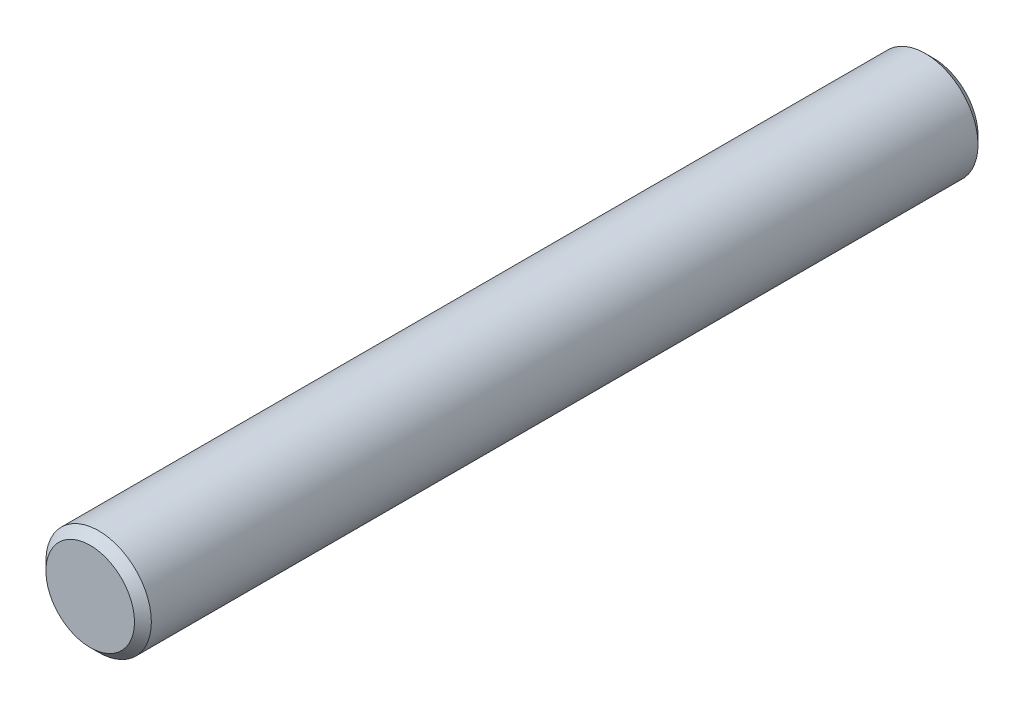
ISO-10303-21;
HEADER;
FILE_DESCRIPTION(('STEP AP214'),'2;1');
FILE_NAME('part.step','',(''),(''),'','','');
FILE_SCHEMA(('AUTOMOTIVE_DESIGN { 1 0 10303 214 1 1 1 1 }'));
ENDSEC;
DATA;
#1=APPLICATION_CONTEXT('core data for automotive mechanical design processes');
#2=APPLICATION_PROTOCOL_DEFINITION('international standard','automotive_design',2000,#1);
#3=PRODUCT_CONTEXT('',#1,'mechanical');
#4=PRODUCT('Part','Part','',(#3));
#5=PRODUCT_RELATED_PRODUCT_CATEGORY('part','',(#4));
#6=PRODUCT_DEFINITION_FORMATION('','',#4);
#7=PRODUCT_DEFINITION_CONTEXT('part definition',#1,'design');
#8=PRODUCT_DEFINITION('design','',#6,#7);
#9=PRODUCT_DEFINITION_SHAPE('','',#8);
#10=(LENGTH_UNIT() NAMED_UNIT(*) SI_UNIT(.MILLI.,.METRE.));
#11=(NAMED_UNIT(*) PLANE_ANGLE_UNIT() SI_UNIT($,.RADIAN.));
#12=(NAMED_UNIT(*) SI_UNIT($,.STERADIAN.) SOLID_ANGLE_UNIT());
#13=UNCERTAINTY_MEASURE_WITH_UNIT(LENGTH_MEASURE(1.E-05),#10,'distance_accuracy_value','');
#14=(GEOMETRIC_REPRESENTATION_CONTEXT(3) GLOBAL_UNCERTAINTY_ASSIGNED_CONTEXT((#13)) GLOBAL_UNIT_ASSIGNED_CONTEXT((#10,
#11,#12)) REPRESENTATION_CONTEXT('',''));
#15=CARTESIAN_POINT('',(0.,0.,0.));
#16=DIRECTION('',(0.,0.,1.));
#17=DIRECTION('',(1.,0.,0.));
#18=AXIS2_PLACEMENT_3D('',#15,#16,#17);
#19=CARTESIAN_POINT('',(0.,0.,25.4));
#20=DIRECTION('',(0.,0.,-1.));
#21=DIRECTION('',(-1.,0.,0.));
#22=AXIS2_PLACEMENT_3D('',#19,#20,#21);
#23=CYLINDRICAL_SURFACE('',#22,1.5875);
#24=CARTESIAN_POINT('',(0.,0.,0.254000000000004));
#25=DIRECTION('',(0.,0.,1.));
#26=DIRECTION('',(1.,0.,0.));
#27=AXIS2_PLACEMENT_3D('',#24,#25,#26);
#28=CIRCLE('',#27,1.5875);
#29=CARTESIAN_POINT('',(1.5875,0.,0.254000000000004));
#30=VERTEX_POINT('',#29);
#31=EDGE_CURVE('E59',#30,#30,#28,.T.);
#32=ORIENTED_EDGE('',*,*,#31,.T.);
#33=EDGE_LOOP('',(#32));
#34=FACE_BOUND('',#33,.T.);
#35=CARTESIAN_POINT('',(0.,0.,25.146));
#36=DIRECTION('',(0.,0.,1.));
#37=DIRECTION('',(1.,0.,0.));
#38=AXIS2_PLACEMENT_3D('',#35,#36,#37);
#39=CIRCLE('',#38,1.5875);
#40=CARTESIAN_POINT('',(1.5875,0.,25.146));
#41=VERTEX_POINT('',#40);
#42=EDGE_CURVE('E64',#41,#41,#39,.F.);
#43=ORIENTED_EDGE('',*,*,#42,.T.);
#44=EDGE_LOOP('',(#43));
#45=FACE_BOUND('',#44,.T.);
#46=ADVANCED_FACE('F45',(#34,#45),#23,.T.);
#47=CARTESIAN_POINT('',(0.,0.,25.4));
#48=DIRECTION('',(0.,0.,1.));
#49=DIRECTION('',(1.,0.,0.));
#50=AXIS2_PLACEMENT_3D('',#47,#48,#49);
#51=PLANE('',#50);
#52=CARTESIAN_POINT('',(0.,0.,25.4));
#53=DIRECTION('',(0.,0.,1.));
#54=DIRECTION('',(1.,0.,0.));
#55=AXIS2_PLACEMENT_3D('',#52,#53,#54);
#56=CIRCLE('',#55,1.33350000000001);
#57=CARTESIAN_POINT('',(1.33350000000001,0.,25.4));
#58=VERTEX_POINT('',#57);
#59=EDGE_CURVE('E10',#58,#58,#56,.T.);
#60=ORIENTED_EDGE('',*,*,#59,.T.);
#61=EDGE_LOOP('',(#60));
#62=FACE_BOUND('',#61,.T.);
#63=ADVANCED_FACE('F81',(#62),#51,.T.);
#64=CARTESIAN_POINT('',(0.,0.,0.));
#65=DIRECTION('',(0.,0.,1.));
#66=DIRECTION('',(1.,0.,0.));
#67=AXIS2_PLACEMENT_3D('',#64,#65,#66);
#68=PLANE('',#67);
#69=CARTESIAN_POINT('',(0.,0.,0.));
#70=DIRECTION('',(0.,0.,1.));
#71=DIRECTION('',(1.,0.,0.));
#72=AXIS2_PLACEMENT_3D('',#69,#70,#71);
#73=CIRCLE('',#72,1.33349999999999);
#74=CARTESIAN_POINT('',(1.33349999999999,0.,0.));
#75=VERTEX_POINT('',#74);
#76=EDGE_CURVE('E54',#75,#75,#73,.F.);
#77=ORIENTED_EDGE('',*,*,#76,.T.);
#78=EDGE_LOOP('',(#77));
#79=FACE_BOUND('',#78,.T.);
#80=ADVANCED_FACE('F78',(#79),#68,.F.);
#81=CARTESIAN_POINT('',(0.,0.,0.254000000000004));
#82=DIRECTION('',(0.,0.,1.));
#83=DIRECTION('',(1.,0.,0.));
#84=AXIS2_PLACEMENT_3D('',#81,#82,#83);
#85=CONICAL_SURFACE('',#84,1.5875,0.785398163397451);
#86=ORIENTED_EDGE('',*,*,#76,.F.);
#87=EDGE_LOOP('',(#86));
#88=FACE_BOUND('',#87,.T.);
#89=ORIENTED_EDGE('',*,*,#31,.F.);
#90=EDGE_LOOP('',(#89));
#91=FACE_BOUND('',#90,.T.);
#92=ADVANCED_FACE('F74',(#88,#91),#85,.T.);
#93=CARTESIAN_POINT('',(0.,0.,25.4));
#94=DIRECTION('',(0.,0.,-1.));
#95=DIRECTION('',(-1.,0.,0.));
#96=AXIS2_PLACEMENT_3D('',#93,#94,#95);
#97=CONICAL_SURFACE('',#96,1.33350000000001,0.785398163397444);
#98=ORIENTED_EDGE('',*,*,#42,.F.);
#99=EDGE_LOOP('',(#98));
#100=FACE_BOUND('',#99,.T.);
#101=ORIENTED_EDGE('',*,*,#59,.F.);
#102=EDGE_LOOP('',(#101));
#103=FACE_BOUND('',#102,.T.);
#104=ADVANCED_FACE('F48',(#100,#103),#97,.T.);
#105=CLOSED_SHELL('',(#46,#63,#80,#92,#104));
#106=MANIFOLD_SOLID_BREP('B2',#105);
#107=ADVANCED_BREP_SHAPE_REPRESENTATION('',(#18,#106),#14);
#108=SHAPE_DEFINITION_REPRESENTATION(#9,#107);
ENDSEC;
END-ISO-10303-21;
